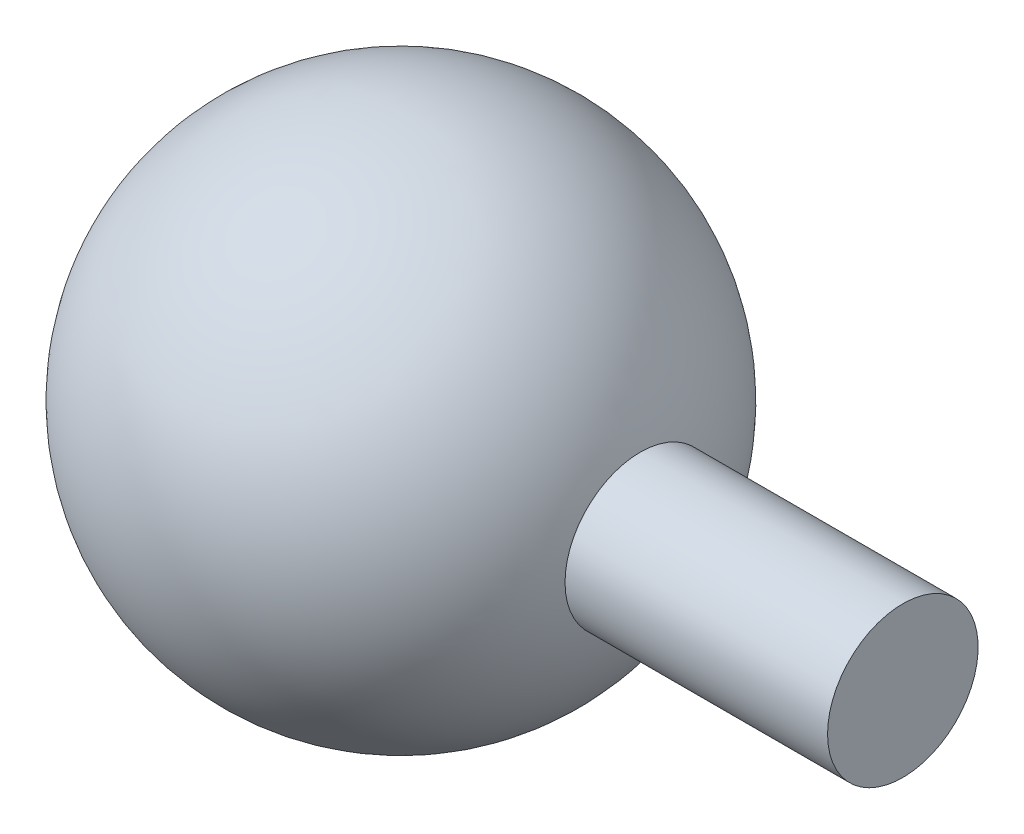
ISO-10303-21;
HEADER;
FILE_DESCRIPTION(('STEP AP214'),'2;1');
FILE_NAME('part.step','',(''),(''),'','','');
FILE_SCHEMA(('AUTOMOTIVE_DESIGN { 1 0 10303 214 1 1 1 1 }'));
ENDSEC;
DATA;
#1=APPLICATION_CONTEXT('core data for automotive mechanical design processes');
#2=APPLICATION_PROTOCOL_DEFINITION('international standard','automotive_design',2000,#1);
#3=PRODUCT_CONTEXT('',#1,'mechanical');
#4=PRODUCT('Part','Part','',(#3));
#5=PRODUCT_RELATED_PRODUCT_CATEGORY('part','',(#4));
#6=PRODUCT_DEFINITION_FORMATION('','',#4);
#7=PRODUCT_DEFINITION_CONTEXT('part definition',#1,'design');
#8=PRODUCT_DEFINITION('design','',#6,#7);
#9=PRODUCT_DEFINITION_SHAPE('','',#8);
#10=(LENGTH_UNIT() NAMED_UNIT(*) SI_UNIT(.MILLI.,.METRE.));
#11=(NAMED_UNIT(*) PLANE_ANGLE_UNIT() SI_UNIT($,.RADIAN.));
#12=(NAMED_UNIT(*) SI_UNIT($,.STERADIAN.) SOLID_ANGLE_UNIT());
#13=UNCERTAINTY_MEASURE_WITH_UNIT(LENGTH_MEASURE(1.E-05),#10,'distance_accuracy_value','');
#14=(GEOMETRIC_REPRESENTATION_CONTEXT(3) GLOBAL_UNCERTAINTY_ASSIGNED_CONTEXT((#13)) GLOBAL_UNIT_ASSIGNED_CONTEXT((#10,
#11,#12)) REPRESENTATION_CONTEXT('',''));
#15=CARTESIAN_POINT('',(0.,0.,0.));
#16=DIRECTION('',(0.,0.,1.));
#17=DIRECTION('',(1.,0.,0.));
#18=AXIS2_PLACEMENT_3D('',#15,#16,#17);
#19=CARTESIAN_POINT('',(0.,0.,0.));
#20=DIRECTION('',(-1.,0.,0.));
#21=DIRECTION('',(0.,1.,0.));
#22=AXIS2_PLACEMENT_3D('',#19,#20,#21);
#23=SPHERICAL_SURFACE('',#22,50.);
#24=CARTESIAN_POINT('',(47.6969600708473,0.,0.));
#25=DIRECTION('',(-1.,0.,0.));
#26=DIRECTION('',(0.,0.,1.));
#27=AXIS2_PLACEMENT_3D('',#24,#25,#26);
#28=CIRCLE('',#27,15.);
#29=CARTESIAN_POINT('',(47.6969600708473,0.,15.));
#30=VERTEX_POINT('',#29);
#31=EDGE_CURVE('E35',#30,#30,#28,.T.);
#32=ORIENTED_EDGE('',*,*,#31,.T.);
#33=EDGE_LOOP('',(#32));
#34=FACE_BOUND('',#33,.T.);
#35=ADVANCED_FACE('F29',(#34),#23,.T.);
#36=CARTESIAN_POINT('',(100.,15.,0.));
#37=DIRECTION('',(-1.,0.,0.));
#38=DIRECTION('',(0.,0.,1.));
#39=AXIS2_PLACEMENT_3D('',#36,#37,#38);
#40=PLANE('',#39);
#41=CARTESIAN_POINT('',(100.,0.,0.));
#42=DIRECTION('',(-1.,0.,0.));
#43=DIRECTION('',(0.,0.,1.));
#44=AXIS2_PLACEMENT_3D('',#41,#42,#43);
#45=CIRCLE('',#44,15.);
#46=CARTESIAN_POINT('',(100.,0.,15.));
#47=VERTEX_POINT('',#46);
#48=EDGE_CURVE('E10',#47,#47,#45,.T.);
#49=ORIENTED_EDGE('',*,*,#48,.F.);
#50=EDGE_LOOP('',(#49));
#51=FACE_BOUND('',#50,.T.);
#52=ADVANCED_FACE('F44',(#51),#40,.F.);
#53=CARTESIAN_POINT('',(0.,0.,0.));
#54=DIRECTION('',(-1.,0.,0.));
#55=DIRECTION('',(0.,0.,1.));
#56=AXIS2_PLACEMENT_3D('',#53,#54,#55);
#57=CYLINDRICAL_SURFACE('',#56,15.);
#58=ORIENTED_EDGE('',*,*,#31,.F.);
#59=EDGE_LOOP('',(#58));
#60=FACE_BOUND('',#59,.T.);
#61=ORIENTED_EDGE('',*,*,#48,.T.);
#62=EDGE_LOOP('',(#61));
#63=FACE_BOUND('',#62,.T.);
#64=ADVANCED_FACE('F42',(#60,#63),#57,.T.);
#65=CLOSED_SHELL('',(#35,#52,#64));
#66=MANIFOLD_SOLID_BREP('B2',#65);
#67=ADVANCED_BREP_SHAPE_REPRESENTATION('',(#18,#66),#14);
#68=SHAPE_DEFINITION_REPRESENTATION(#9,#67);
ENDSEC;
END-ISO-10303-21;
